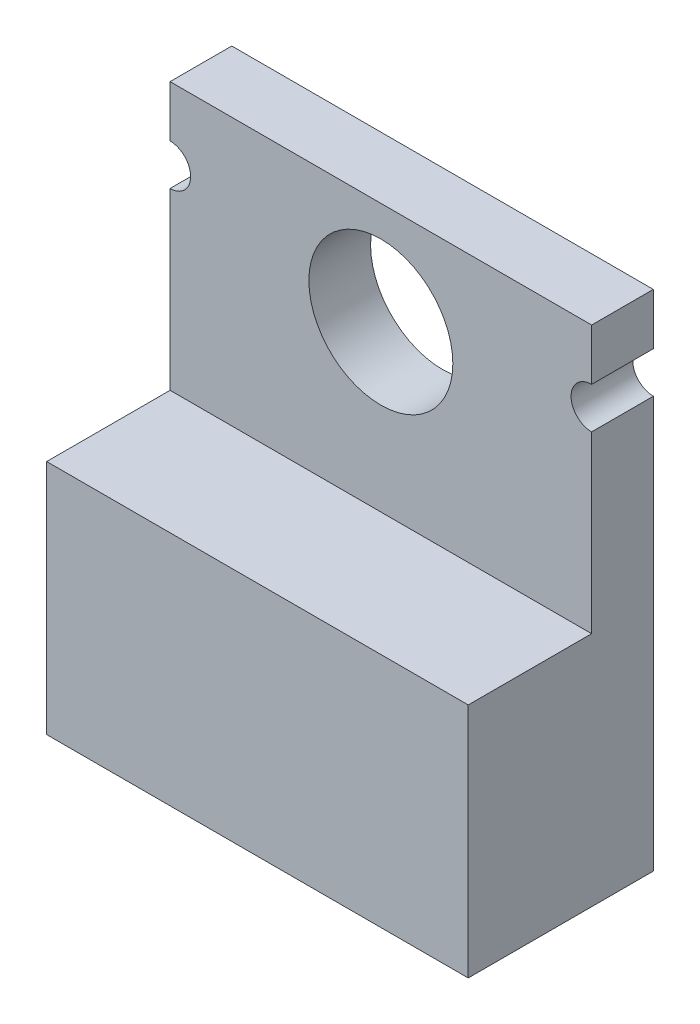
ISO-10303-21;
HEADER;
FILE_DESCRIPTION(('STEP AP214'),'2;1');
FILE_NAME('part.step','',(''),(''),'','','');
FILE_SCHEMA(('AUTOMOTIVE_DESIGN { 1 0 10303 214 1 1 1 1 }'));
ENDSEC;
DATA;
#1=APPLICATION_CONTEXT('core data for automotive mechanical design processes');
#2=APPLICATION_PROTOCOL_DEFINITION('international standard','automotive_design',2000,#1);
#3=PRODUCT_CONTEXT('',#1,'mechanical');
#4=PRODUCT('Part','Part','',(#3));
#5=PRODUCT_RELATED_PRODUCT_CATEGORY('part','',(#4));
#6=PRODUCT_DEFINITION_FORMATION('','',#4);
#7=PRODUCT_DEFINITION_CONTEXT('part definition',#1,'design');
#8=PRODUCT_DEFINITION('design','',#6,#7);
#9=PRODUCT_DEFINITION_SHAPE('','',#8);
#10=(LENGTH_UNIT() NAMED_UNIT(*) SI_UNIT(.MILLI.,.METRE.));
#11=(NAMED_UNIT(*) PLANE_ANGLE_UNIT() SI_UNIT($,.RADIAN.));
#12=(NAMED_UNIT(*) SI_UNIT($,.STERADIAN.) SOLID_ANGLE_UNIT());
#13=UNCERTAINTY_MEASURE_WITH_UNIT(LENGTH_MEASURE(1.E-05),#10,'distance_accuracy_value','');
#14=(GEOMETRIC_REPRESENTATION_CONTEXT(3) GLOBAL_UNCERTAINTY_ASSIGNED_CONTEXT((#13)) GLOBAL_UNIT_ASSIGNED_CONTEXT((#10,
#11,#12)) REPRESENTATION_CONTEXT('',''));
#15=CARTESIAN_POINT('',(0.,0.,0.));
#16=DIRECTION('',(0.,0.,1.));
#17=DIRECTION('',(1.,0.,0.));
#18=AXIS2_PLACEMENT_3D('',#15,#16,#17);
#19=CARTESIAN_POINT('',(0.,10.668,1.524));
#20=DIRECTION('',(0.,0.,-1.));
#21=DIRECTION('',(-1.,0.,0.));
#22=AXIS2_PLACEMENT_3D('',#19,#20,#21);
#23=PLANE('',#22);
#24=CARTESIAN_POINT('',(5.207,9.906,1.524));
#25=DIRECTION('',(0.,0.,1.));
#26=DIRECTION('',(1.,0.,0.));
#27=AXIS2_PLACEMENT_3D('',#24,#25,#26);
#28=CIRCLE('',#27,1.778);
#29=CARTESIAN_POINT('',(3.429,9.906,1.524));
#30=VERTEX_POINT('',#29);
#31=EDGE_CURVE('E144',#30,#30,#28,.T.);
#32=ORIENTED_EDGE('',*,*,#31,.F.);
#33=EDGE_LOOP('',(#32));
#34=FACE_BOUND('',#33,.T.);
#35=DIRECTION('',(-1.,0.,0.));
#36=VECTOR('',#35,1.);
#37=CARTESIAN_POINT('',(0.,5.842,1.524));
#38=LINE('',#37,#36);
#39=CARTESIAN_POINT('',(10.414,5.842,1.524));
#40=VERTEX_POINT('',#39);
#41=CARTESIAN_POINT('',(0.,5.842,1.524));
#42=VERTEX_POINT('',#41);
#43=EDGE_CURVE('E46',#40,#42,#38,.T.);
#44=ORIENTED_EDGE('',*,*,#43,.F.);
#45=DIRECTION('',(0.,1.,0.));
#46=VECTOR('',#45,1.);
#47=CARTESIAN_POINT('',(10.414,0.,1.524));
#48=LINE('',#47,#46);
#49=CARTESIAN_POINT('',(10.414,10.16,1.524));
#50=VERTEX_POINT('',#49);
#51=EDGE_CURVE('E109',#40,#50,#48,.T.);
#52=ORIENTED_EDGE('',*,*,#51,.T.);
#53=CARTESIAN_POINT('',(10.414,10.668,1.524));
#54=DIRECTION('',(0.,0.,-1.));
#55=DIRECTION('',(1.,0.,0.));
#56=AXIS2_PLACEMENT_3D('',#53,#54,#55);
#57=CIRCLE('',#56,0.508);
#58=CARTESIAN_POINT('',(10.414,11.176,1.524));
#59=VERTEX_POINT('',#58);
#60=EDGE_CURVE('E191',#50,#59,#57,.T.);
#61=ORIENTED_EDGE('',*,*,#60,.T.);
#62=DIRECTION('',(0.,1.,0.));
#63=VECTOR('',#62,1.);
#64=CARTESIAN_POINT('',(10.414,11.176,1.524));
#65=LINE('',#64,#63);
#66=CARTESIAN_POINT('',(10.414,12.446,1.524));
#67=VERTEX_POINT('',#66);
#68=EDGE_CURVE('E190',#59,#67,#65,.T.);
#69=ORIENTED_EDGE('',*,*,#68,.T.);
#70=DIRECTION('',(-1.,0.,0.));
#71=VECTOR('',#70,1.);
#72=CARTESIAN_POINT('',(0.,12.446,1.524));
#73=LINE('',#72,#71);
#74=CARTESIAN_POINT('',(0.,12.446,1.524));
#75=VERTEX_POINT('',#74);
#76=EDGE_CURVE('E188',#67,#75,#73,.T.);
#77=ORIENTED_EDGE('',*,*,#76,.T.);
#78=DIRECTION('',(0.,-1.,0.));
#79=VECTOR('',#78,1.);
#80=CARTESIAN_POINT('',(0.,11.176,1.524));
#81=LINE('',#80,#79);
#82=CARTESIAN_POINT('',(0.,11.176,1.524));
#83=VERTEX_POINT('',#82);
#84=EDGE_CURVE('E186',#75,#83,#81,.T.);
#85=ORIENTED_EDGE('',*,*,#84,.T.);
#86=CARTESIAN_POINT('',(0.,10.668,1.524));
#87=DIRECTION('',(0.,0.,-1.));
#88=DIRECTION('',(-1.,0.,0.));
#89=AXIS2_PLACEMENT_3D('',#86,#87,#88);
#90=CIRCLE('',#89,0.508);
#91=CARTESIAN_POINT('',(0.,10.16,1.524));
#92=VERTEX_POINT('',#91);
#93=EDGE_CURVE('E52',#83,#92,#90,.T.);
#94=ORIENTED_EDGE('',*,*,#93,.T.);
#95=DIRECTION('',(0.,-1.,0.));
#96=VECTOR('',#95,1.);
#97=CARTESIAN_POINT('',(0.,0.,1.524));
#98=LINE('',#97,#96);
#99=EDGE_CURVE('E105',#92,#42,#98,.T.);
#100=ORIENTED_EDGE('',*,*,#99,.T.);
#101=EDGE_LOOP('',(#44,#52,#61,#69,#77,#85,#94,#100));
#102=FACE_BOUND('',#101,.T.);
#103=ADVANCED_FACE('F29',(#34,#102),#23,.F.);
#104=CARTESIAN_POINT('',(0.,10.668,0.));
#105=DIRECTION('',(0.,0.,-1.));
#106=DIRECTION('',(-1.,0.,0.));
#107=AXIS2_PLACEMENT_3D('',#104,#105,#106);
#108=PLANE('',#107);
#109=DIRECTION('',(0.,-1.,0.));
#110=VECTOR('',#109,1.);
#111=CARTESIAN_POINT('',(0.,0.,0.));
#112=LINE('',#111,#110);
#113=CARTESIAN_POINT('',(0.,10.16,0.));
#114=VERTEX_POINT('',#113);
#115=CARTESIAN_POINT('',(0.,0.,0.));
#116=VERTEX_POINT('',#115);
#117=EDGE_CURVE('E147',#114,#116,#112,.T.);
#118=ORIENTED_EDGE('',*,*,#117,.F.);
#119=CARTESIAN_POINT('',(0.,10.668,0.));
#120=DIRECTION('',(0.,0.,-1.));
#121=DIRECTION('',(-1.,0.,0.));
#122=AXIS2_PLACEMENT_3D('',#119,#120,#121);
#123=CIRCLE('',#122,0.508);
#124=CARTESIAN_POINT('',(0.,11.176,0.));
#125=VERTEX_POINT('',#124);
#126=EDGE_CURVE('E110',#125,#114,#123,.T.);
#127=ORIENTED_EDGE('',*,*,#126,.F.);
#128=DIRECTION('',(0.,-1.,0.));
#129=VECTOR('',#128,1.);
#130=CARTESIAN_POINT('',(0.,11.176,0.));
#131=LINE('',#130,#129);
#132=CARTESIAN_POINT('',(0.,12.446,0.));
#133=VERTEX_POINT('',#132);
#134=EDGE_CURVE('E159',#133,#125,#131,.T.);
#135=ORIENTED_EDGE('',*,*,#134,.F.);
#136=DIRECTION('',(-1.,0.,0.));
#137=VECTOR('',#136,1.);
#138=CARTESIAN_POINT('',(0.,12.446,0.));
#139=LINE('',#138,#137);
#140=CARTESIAN_POINT('',(10.414,12.446,0.));
#141=VERTEX_POINT('',#140);
#142=EDGE_CURVE('E157',#141,#133,#139,.T.);
#143=ORIENTED_EDGE('',*,*,#142,.F.);
#144=DIRECTION('',(0.,1.,0.));
#145=VECTOR('',#144,1.);
#146=CARTESIAN_POINT('',(10.414,11.176,0.));
#147=LINE('',#146,#145);
#148=CARTESIAN_POINT('',(10.414,11.176,0.));
#149=VERTEX_POINT('',#148);
#150=EDGE_CURVE('E155',#149,#141,#147,.T.);
#151=ORIENTED_EDGE('',*,*,#150,.F.);
#152=CARTESIAN_POINT('',(10.414,10.668,0.));
#153=DIRECTION('',(0.,0.,-1.));
#154=DIRECTION('',(1.,0.,0.));
#155=AXIS2_PLACEMENT_3D('',#152,#153,#154);
#156=CIRCLE('',#155,0.508);
#157=CARTESIAN_POINT('',(10.414,10.16,0.));
#158=VERTEX_POINT('',#157);
#159=EDGE_CURVE('E153',#158,#149,#156,.T.);
#160=ORIENTED_EDGE('',*,*,#159,.F.);
#161=DIRECTION('',(0.,1.,0.));
#162=VECTOR('',#161,1.);
#163=CARTESIAN_POINT('',(10.414,0.,0.));
#164=LINE('',#163,#162);
#165=CARTESIAN_POINT('',(10.414,0.,0.));
#166=VERTEX_POINT('',#165);
#167=EDGE_CURVE('E151',#166,#158,#164,.T.);
#168=ORIENTED_EDGE('',*,*,#167,.F.);
#169=DIRECTION('',(1.,0.,0.));
#170=VECTOR('',#169,1.);
#171=CARTESIAN_POINT('',(0.,0.,0.));
#172=LINE('',#171,#170);
#173=EDGE_CURVE('E149',#116,#166,#172,.T.);
#174=ORIENTED_EDGE('',*,*,#173,.F.);
#175=EDGE_LOOP('',(#118,#127,#135,#143,#151,#160,#168,#174));
#176=FACE_BOUND('',#175,.T.);
#177=CARTESIAN_POINT('',(5.207,9.906,0.));
#178=DIRECTION('',(0.,0.,1.));
#179=DIRECTION('',(1.,0.,0.));
#180=AXIS2_PLACEMENT_3D('',#177,#178,#179);
#181=CIRCLE('',#180,1.778);
#182=CARTESIAN_POINT('',(3.429,9.906,0.));
#183=VERTEX_POINT('',#182);
#184=EDGE_CURVE('E127',#183,#183,#181,.T.);
#185=ORIENTED_EDGE('',*,*,#184,.T.);
#186=EDGE_LOOP('',(#185));
#187=FACE_BOUND('',#186,.T.);
#188=ADVANCED_FACE('F221',(#176,#187),#108,.T.);
#189=CARTESIAN_POINT('',(0.,0.,1.524));
#190=DIRECTION('',(1.,0.,0.));
#191=DIRECTION('',(0.,0.,-1.));
#192=AXIS2_PLACEMENT_3D('',#189,#190,#191);
#193=PLANE('',#192);
#194=ORIENTED_EDGE('',*,*,#117,.T.);
#195=DIRECTION('',(0.,0.,-1.));
#196=VECTOR('',#195,1.);
#197=CARTESIAN_POINT('',(0.,0.,1.524));
#198=LINE('',#197,#196);
#199=CARTESIAN_POINT('',(0.,0.,4.572));
#200=VERTEX_POINT('',#199);
#201=EDGE_CURVE('E11',#200,#116,#198,.T.);
#202=ORIENTED_EDGE('',*,*,#201,.F.);
#203=DIRECTION('',(0.,-1.,0.));
#204=VECTOR('',#203,1.);
#205=CARTESIAN_POINT('',(0.,0.,4.572));
#206=LINE('',#205,#204);
#207=CARTESIAN_POINT('',(0.,5.842,4.572));
#208=VERTEX_POINT('',#207);
#209=EDGE_CURVE('E121',#208,#200,#206,.T.);
#210=ORIENTED_EDGE('',*,*,#209,.F.);
#211=DIRECTION('',(0.,0.,-1.));
#212=VECTOR('',#211,1.);
#213=CARTESIAN_POINT('',(0.,5.842,4.572));
#214=LINE('',#213,#212);
#215=EDGE_CURVE('E117',#208,#42,#214,.T.);
#216=ORIENTED_EDGE('',*,*,#215,.T.);
#217=ORIENTED_EDGE('',*,*,#99,.F.);
#218=DIRECTION('',(0.,0.,-1.));
#219=VECTOR('',#218,1.);
#220=CARTESIAN_POINT('',(0.,10.16,1.524));
#221=LINE('',#220,#219);
#222=EDGE_CURVE('E183',#92,#114,#221,.T.);
#223=ORIENTED_EDGE('',*,*,#222,.T.);
#224=EDGE_LOOP('',(#194,#202,#210,#216,#217,#223));
#225=FACE_BOUND('',#224,.T.);
#226=ADVANCED_FACE('F31',(#225),#193,.F.);
#227=CARTESIAN_POINT('',(0.,0.,1.524));
#228=DIRECTION('',(0.,1.,0.));
#229=DIRECTION('',(0.,0.,1.));
#230=AXIS2_PLACEMENT_3D('',#227,#228,#229);
#231=PLANE('',#230);
#232=ORIENTED_EDGE('',*,*,#173,.T.);
#233=DIRECTION('',(0.,0.,-1.));
#234=VECTOR('',#233,1.);
#235=CARTESIAN_POINT('',(10.414,0.,1.524));
#236=LINE('',#235,#234);
#237=CARTESIAN_POINT('',(10.414,0.,4.572));
#238=VERTEX_POINT('',#237);
#239=EDGE_CURVE('E38',#238,#166,#236,.T.);
#240=ORIENTED_EDGE('',*,*,#239,.F.);
#241=DIRECTION('',(1.,0.,0.));
#242=VECTOR('',#241,1.);
#243=CARTESIAN_POINT('',(0.,0.,4.572));
#244=LINE('',#243,#242);
#245=EDGE_CURVE('E138',#200,#238,#244,.T.);
#246=ORIENTED_EDGE('',*,*,#245,.F.);
#247=ORIENTED_EDGE('',*,*,#201,.T.);
#248=EDGE_LOOP('',(#232,#240,#246,#247));
#249=FACE_BOUND('',#248,.T.);
#250=ADVANCED_FACE('F225',(#249),#231,.F.);
#251=CARTESIAN_POINT('',(10.414,0.,1.524));
#252=DIRECTION('',(-1.,0.,0.));
#253=DIRECTION('',(0.,-1.,0.));
#254=AXIS2_PLACEMENT_3D('',#251,#252,#253);
#255=PLANE('',#254);
#256=ORIENTED_EDGE('',*,*,#167,.T.);
#257=DIRECTION('',(0.,0.,-1.));
#258=VECTOR('',#257,1.);
#259=CARTESIAN_POINT('',(10.414,10.16,1.524));
#260=LINE('',#259,#258);
#261=EDGE_CURVE('E168',#50,#158,#260,.T.);
#262=ORIENTED_EDGE('',*,*,#261,.F.);
#263=ORIENTED_EDGE('',*,*,#51,.F.);
#264=DIRECTION('',(0.,0.,-1.));
#265=VECTOR('',#264,1.);
#266=CARTESIAN_POINT('',(10.414,5.842,4.572));
#267=LINE('',#266,#265);
#268=CARTESIAN_POINT('',(10.414,5.842,4.572));
#269=VERTEX_POINT('',#268);
#270=EDGE_CURVE('E120',#269,#40,#267,.T.);
#271=ORIENTED_EDGE('',*,*,#270,.F.);
#272=DIRECTION('',(0.,1.,0.));
#273=VECTOR('',#272,1.);
#274=CARTESIAN_POINT('',(10.414,0.,4.572));
#275=LINE('',#274,#273);
#276=EDGE_CURVE('E128',#238,#269,#275,.T.);
#277=ORIENTED_EDGE('',*,*,#276,.F.);
#278=ORIENTED_EDGE('',*,*,#239,.T.);
#279=EDGE_LOOP('',(#256,#262,#263,#271,#277,#278));
#280=FACE_BOUND('',#279,.T.);
#281=ADVANCED_FACE('F196',(#280),#255,.F.);
#282=CARTESIAN_POINT('',(10.414,10.668,1.524));
#283=DIRECTION('',(0.,0.,-1.));
#284=DIRECTION('',(-1.,0.,0.));
#285=AXIS2_PLACEMENT_3D('',#282,#283,#284);
#286=CYLINDRICAL_SURFACE('',#285,0.508);
#287=ORIENTED_EDGE('',*,*,#159,.T.);
#288=DIRECTION('',(0.,0.,-1.));
#289=VECTOR('',#288,1.);
#290=CARTESIAN_POINT('',(10.414,11.176,1.524));
#291=LINE('',#290,#289);
#292=EDGE_CURVE('E171',#59,#149,#291,.T.);
#293=ORIENTED_EDGE('',*,*,#292,.F.);
#294=ORIENTED_EDGE('',*,*,#60,.F.);
#295=ORIENTED_EDGE('',*,*,#261,.T.);
#296=EDGE_LOOP('',(#287,#293,#294,#295));
#297=FACE_BOUND('',#296,.T.);
#298=ADVANCED_FACE('F200',(#297),#286,.F.);
#299=CARTESIAN_POINT('',(10.414,11.176,1.524));
#300=DIRECTION('',(-1.,0.,0.));
#301=DIRECTION('',(0.,0.,1.));
#302=AXIS2_PLACEMENT_3D('',#299,#300,#301);
#303=PLANE('',#302);
#304=ORIENTED_EDGE('',*,*,#150,.T.);
#305=DIRECTION('',(0.,0.,-1.));
#306=VECTOR('',#305,1.);
#307=CARTESIAN_POINT('',(10.414,12.446,1.524));
#308=LINE('',#307,#306);
#309=EDGE_CURVE('E174',#67,#141,#308,.T.);
#310=ORIENTED_EDGE('',*,*,#309,.F.);
#311=ORIENTED_EDGE('',*,*,#68,.F.);
#312=ORIENTED_EDGE('',*,*,#292,.T.);
#313=EDGE_LOOP('',(#304,#310,#311,#312));
#314=FACE_BOUND('',#313,.T.);
#315=ADVANCED_FACE('F205',(#314),#303,.F.);
#316=CARTESIAN_POINT('',(0.,12.446,1.524));
#317=DIRECTION('',(0.,-1.,0.));
#318=DIRECTION('',(0.,0.,-1.));
#319=AXIS2_PLACEMENT_3D('',#316,#317,#318);
#320=PLANE('',#319);
#321=ORIENTED_EDGE('',*,*,#142,.T.);
#322=DIRECTION('',(0.,0.,-1.));
#323=VECTOR('',#322,1.);
#324=CARTESIAN_POINT('',(0.,12.446,1.524));
#325=LINE('',#324,#323);
#326=EDGE_CURVE('E177',#75,#133,#325,.T.);
#327=ORIENTED_EDGE('',*,*,#326,.F.);
#328=ORIENTED_EDGE('',*,*,#76,.F.);
#329=ORIENTED_EDGE('',*,*,#309,.T.);
#330=EDGE_LOOP('',(#321,#327,#328,#329));
#331=FACE_BOUND('',#330,.T.);
#332=ADVANCED_FACE('F211',(#331),#320,.F.);
#333=CARTESIAN_POINT('',(0.,11.176,1.524));
#334=DIRECTION('',(1.,0.,0.));
#335=DIRECTION('',(0.,0.,-1.));
#336=AXIS2_PLACEMENT_3D('',#333,#334,#335);
#337=PLANE('',#336);
#338=ORIENTED_EDGE('',*,*,#134,.T.);
#339=DIRECTION('',(0.,0.,-1.));
#340=VECTOR('',#339,1.);
#341=CARTESIAN_POINT('',(0.,11.176,1.524));
#342=LINE('',#341,#340);
#343=EDGE_CURVE('E180',#83,#125,#342,.T.);
#344=ORIENTED_EDGE('',*,*,#343,.F.);
#345=ORIENTED_EDGE('',*,*,#84,.F.);
#346=ORIENTED_EDGE('',*,*,#326,.T.);
#347=EDGE_LOOP('',(#338,#344,#345,#346));
#348=FACE_BOUND('',#347,.T.);
#349=ADVANCED_FACE('F215',(#348),#337,.F.);
#350=CARTESIAN_POINT('',(0.,10.668,1.524));
#351=DIRECTION('',(0.,0.,-1.));
#352=DIRECTION('',(-1.,0.,0.));
#353=AXIS2_PLACEMENT_3D('',#350,#351,#352);
#354=CYLINDRICAL_SURFACE('',#353,0.508);
#355=ORIENTED_EDGE('',*,*,#126,.T.);
#356=ORIENTED_EDGE('',*,*,#222,.F.);
#357=ORIENTED_EDGE('',*,*,#93,.F.);
#358=ORIENTED_EDGE('',*,*,#343,.T.);
#359=EDGE_LOOP('',(#355,#356,#357,#358));
#360=FACE_BOUND('',#359,.T.);
#361=ADVANCED_FACE('F218',(#360),#354,.F.);
#362=CARTESIAN_POINT('',(5.207,9.906,1.524));
#363=DIRECTION('',(0.,0.,-1.));
#364=DIRECTION('',(-1.,0.,0.));
#365=AXIS2_PLACEMENT_3D('',#362,#363,#364);
#366=CYLINDRICAL_SURFACE('',#365,1.778);
#367=CARTESIAN_POINT('',(3.429,9.906,1.524));
#368=CARTESIAN_POINT('',(3.429,9.906,1.508125));
#369=CARTESIAN_POINT('',(3.429,9.906,1.49225));
#370=CARTESIAN_POINT('',(3.429,9.906,1.4605));
#371=CARTESIAN_POINT('',(3.429,9.906,1.444625));
#372=CARTESIAN_POINT('',(3.429,9.906,1.412875));
#373=CARTESIAN_POINT('',(3.429,9.906,1.397));
#374=CARTESIAN_POINT('',(3.429,9.906,1.36525));
#375=CARTESIAN_POINT('',(3.429,9.906,1.349375));
#376=CARTESIAN_POINT('',(3.429,9.906,1.317625));
#377=CARTESIAN_POINT('',(3.429,9.906,1.30175));
#378=CARTESIAN_POINT('',(3.429,9.906,1.27));
#379=CARTESIAN_POINT('',(3.429,9.906,1.254125));
#380=CARTESIAN_POINT('',(3.429,9.906,1.222375));
#381=CARTESIAN_POINT('',(3.429,9.906,1.2065));
#382=CARTESIAN_POINT('',(3.429,9.906,1.17475));
#383=CARTESIAN_POINT('',(3.429,9.906,1.158875));
#384=CARTESIAN_POINT('',(3.429,9.906,1.127125));
#385=CARTESIAN_POINT('',(3.429,9.906,1.11125));
#386=CARTESIAN_POINT('',(3.429,9.906,1.0795));
#387=CARTESIAN_POINT('',(3.429,9.906,1.063625));
#388=CARTESIAN_POINT('',(3.429,9.906,1.031875));
#389=CARTESIAN_POINT('',(3.429,9.906,1.016));
#390=CARTESIAN_POINT('',(3.429,9.906,0.98425));
#391=CARTESIAN_POINT('',(3.429,9.906,0.968375));
#392=CARTESIAN_POINT('',(3.429,9.906,0.936625));
#393=CARTESIAN_POINT('',(3.429,9.906,0.92075));
#394=CARTESIAN_POINT('',(3.429,9.906,0.889));
#395=CARTESIAN_POINT('',(3.429,9.906,0.873125));
#396=CARTESIAN_POINT('',(3.429,9.906,0.841375));
#397=CARTESIAN_POINT('',(3.429,9.906,0.8255));
#398=CARTESIAN_POINT('',(3.429,9.906,0.79375));
#399=CARTESIAN_POINT('',(3.429,9.906,0.777875));
#400=CARTESIAN_POINT('',(3.429,9.906,0.746125));
#401=CARTESIAN_POINT('',(3.429,9.906,0.73025));
#402=CARTESIAN_POINT('',(3.429,9.906,0.6985));
#403=CARTESIAN_POINT('',(3.429,9.906,0.682625));
#404=CARTESIAN_POINT('',(3.429,9.906,0.650875));
#405=CARTESIAN_POINT('',(3.429,9.906,0.635));
#406=CARTESIAN_POINT('',(3.429,9.906,0.60325));
#407=CARTESIAN_POINT('',(3.429,9.906,0.587375));
#408=CARTESIAN_POINT('',(3.429,9.906,0.555625));
#409=CARTESIAN_POINT('',(3.429,9.906,0.53975));
#410=CARTESIAN_POINT('',(3.429,9.906,0.508));
#411=CARTESIAN_POINT('',(3.429,9.906,0.492125));
#412=CARTESIAN_POINT('',(3.429,9.906,0.460375));
#413=CARTESIAN_POINT('',(3.429,9.906,0.4445));
#414=CARTESIAN_POINT('',(3.429,9.906,0.41275));
#415=CARTESIAN_POINT('',(3.429,9.906,0.396875));
#416=CARTESIAN_POINT('',(3.429,9.906,0.365125));
#417=CARTESIAN_POINT('',(3.429,9.906,0.34925));
#418=CARTESIAN_POINT('',(3.429,9.906,0.3175));
#419=CARTESIAN_POINT('',(3.429,9.906,0.301625));
#420=CARTESIAN_POINT('',(3.429,9.906,0.269875));
#421=CARTESIAN_POINT('',(3.429,9.906,0.254));
#422=CARTESIAN_POINT('',(3.429,9.906,0.22225));
#423=CARTESIAN_POINT('',(3.429,9.906,0.206375));
#424=CARTESIAN_POINT('',(3.429,9.906,0.174625));
#425=CARTESIAN_POINT('',(3.429,9.906,0.15875));
#426=CARTESIAN_POINT('',(3.429,9.906,0.127));
#427=CARTESIAN_POINT('',(3.429,9.906,0.111125));
#428=CARTESIAN_POINT('',(3.429,9.906,0.079375));
#429=CARTESIAN_POINT('',(3.429,9.906,0.0635));
#430=CARTESIAN_POINT('',(3.429,9.906,0.0317499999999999));
#431=CARTESIAN_POINT('',(3.429,9.906,0.015875));
#432=CARTESIAN_POINT('',(3.429,9.906,0.));
#433=B_SPLINE_CURVE_WITH_KNOTS('',3,(#367,#368,#369,#370,#371,#372,#373,#374,#375,#376,#377,
#378,#379,#380,#381,#382,#383,#384,#385,#386,#387,#388,#389,#390,#391,#392,#393,#394,#395,#396,
#397,#398,#399,#400,#401,#402,#403,#404,#405,#406,#407,#408,#409,#410,#411,#412,#413,#414,#415,
#416,#417,#418,#419,#420,#421,#422,#423,#424,#425,#426,#427,#428,#429,#430,#431,#432),
.UNSPECIFIED.,.F.,.F.,(4,2,2,2,2,2,2,2,2,2,2,2,2,2,2,2,2,2,2,2,2,2,2,2,2,2,2,2,2,2,2,2,4),(0.,
0.0476249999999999,0.0952499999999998,0.142875,0.1905,0.238125,0.28575,0.333375,0.381,0.428625,
0.47625,0.523875,0.5715,0.619125,0.66675,0.714375,0.762,0.809625,0.85725,0.904875,0.9525,
1.000125,1.04775,1.095375,1.143,1.190625,1.23825,1.285875,1.3335,1.381125,1.42875,1.476375,
1.524),.UNSPECIFIED.);
#434=EDGE_CURVE('BSEAM234',#30,#183,#433,.T.);
#435=ORIENTED_EDGE('',*,*,#31,.T.);
#436=ORIENTED_EDGE('',*,*,#184,.F.);
#437=ORIENTED_EDGE('',*,*,#434,.T.);
#438=ORIENTED_EDGE('',*,*,#434,.F.);
#439=EDGE_LOOP('',(#435,#437,#436,#438));
#440=FACE_BOUND('',#439,.T.);
#441=ADVANCED_FACE('F234',(#440),#366,.F.);
#442=CARTESIAN_POINT('',(0.,5.842,4.572));
#443=DIRECTION('',(0.,-1.,0.));
#444=DIRECTION('',(0.,0.,-1.));
#445=AXIS2_PLACEMENT_3D('',#442,#443,#444);
#446=PLANE('',#445);
#447=ORIENTED_EDGE('',*,*,#43,.T.);
#448=ORIENTED_EDGE('',*,*,#215,.F.);
#449=DIRECTION('',(-1.,0.,0.));
#450=VECTOR('',#449,1.);
#451=CARTESIAN_POINT('',(0.,5.842,4.572));
#452=LINE('',#451,#450);
#453=EDGE_CURVE('E125',#269,#208,#452,.T.);
#454=ORIENTED_EDGE('',*,*,#453,.F.);
#455=ORIENTED_EDGE('',*,*,#270,.T.);
#456=EDGE_LOOP('',(#447,#448,#454,#455));
#457=FACE_BOUND('',#456,.T.);
#458=ADVANCED_FACE('F115',(#457),#446,.F.);
#459=CARTESIAN_POINT('',(0.,5.842,4.572));
#460=DIRECTION('',(0.,0.,-1.));
#461=DIRECTION('',(-1.,0.,0.));
#462=AXIS2_PLACEMENT_3D('',#459,#460,#461);
#463=PLANE('',#462);
#464=ORIENTED_EDGE('',*,*,#209,.T.);
#465=ORIENTED_EDGE('',*,*,#245,.T.);
#466=ORIENTED_EDGE('',*,*,#276,.T.);
#467=ORIENTED_EDGE('',*,*,#453,.T.);
#468=EDGE_LOOP('',(#464,#465,#466,#467));
#469=FACE_BOUND('',#468,.T.);
#470=ADVANCED_FACE('F228',(#469),#463,.F.);
#471=CLOSED_SHELL('',(#103,#188,#226,#250,#281,#298,#315,#332,#349,#361,#441,#458,#470));
#472=MANIFOLD_SOLID_BREP('B2',#471);
#473=ADVANCED_BREP_SHAPE_REPRESENTATION('',(#18,#472),#14);
#474=SHAPE_DEFINITION_REPRESENTATION(#9,#473);
ENDSEC;
END-ISO-10303-21;
